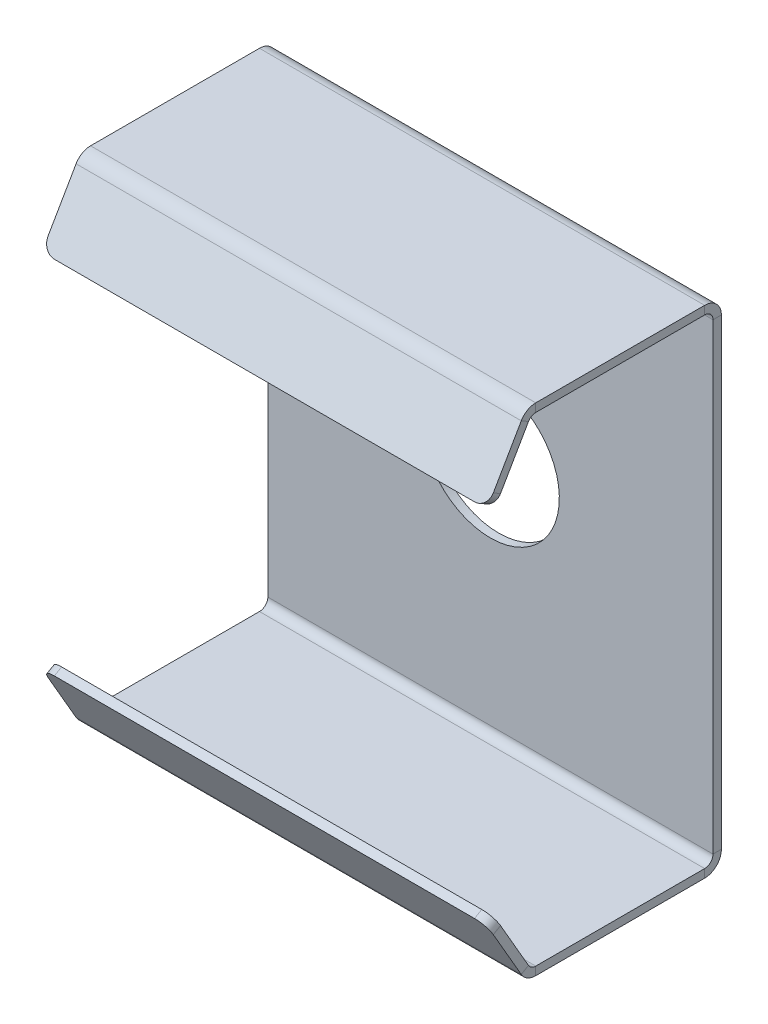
ISO-10303-21;
HEADER;
FILE_DESCRIPTION(('STEP AP214'),'2;1');
FILE_NAME('part.step','',(''),(''),'','','');
FILE_SCHEMA(('AUTOMOTIVE_DESIGN { 1 0 10303 214 1 1 1 1 }'));
ENDSEC;
DATA;
#1=APPLICATION_CONTEXT('core data for automotive mechanical design processes');
#2=APPLICATION_PROTOCOL_DEFINITION('international standard','automotive_design',2000,#1);
#3=PRODUCT_CONTEXT('',#1,'mechanical');
#4=PRODUCT('Part','Part','',(#3));
#5=PRODUCT_RELATED_PRODUCT_CATEGORY('part','',(#4));
#6=PRODUCT_DEFINITION_FORMATION('','',#4);
#7=PRODUCT_DEFINITION_CONTEXT('part definition',#1,'design');
#8=PRODUCT_DEFINITION('design','',#6,#7);
#9=PRODUCT_DEFINITION_SHAPE('','',#8);
#10=(LENGTH_UNIT() NAMED_UNIT(*) SI_UNIT(.MILLI.,.METRE.));
#11=(NAMED_UNIT(*) PLANE_ANGLE_UNIT() SI_UNIT($,.RADIAN.));
#12=(NAMED_UNIT(*) SI_UNIT($,.STERADIAN.) SOLID_ANGLE_UNIT());
#13=UNCERTAINTY_MEASURE_WITH_UNIT(LENGTH_MEASURE(1.E-05),#10,'distance_accuracy_value','');
#14=(GEOMETRIC_REPRESENTATION_CONTEXT(3) GLOBAL_UNCERTAINTY_ASSIGNED_CONTEXT((#13)) GLOBAL_UNIT_ASSIGNED_CONTEXT((#10,
#11,#12)) REPRESENTATION_CONTEXT('',''));
#15=CARTESIAN_POINT('',(0.,0.,0.));
#16=DIRECTION('',(0.,0.,1.));
#17=DIRECTION('',(1.,0.,0.));
#18=AXIS2_PLACEMENT_3D('',#15,#16,#17);
#19=CARTESIAN_POINT('',(2.56286760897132E-13,-73.4431932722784,-4.03249468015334));
#20=DIRECTION('',(0.,-0.5,0.866025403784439));
#21=DIRECTION('',(-1.,0.,0.));
#22=AXIS2_PLACEMENT_3D('',#19,#20,#21);
#23=PLANE('',#22);
#24=CARTESIAN_POINT('',(-25.15,-22.399038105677,25.4378620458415));
#25=DIRECTION('',(0.,-0.5,0.866025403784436));
#26=DIRECTION('',(-0.707106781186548,0.61237243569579,0.35355339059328));
#27=AXIS2_PLACEMENT_3D('',#24,#25,#26);
#28=CIRCLE('',#27,1.5);
#29=CARTESIAN_POINT('',(-25.15,-21.1,26.1878620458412));
#30=VERTEX_POINT('',#29);
#31=CARTESIAN_POINT('',(-26.65,-22.3990381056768,25.4378620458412));
#32=VERTEX_POINT('',#31);
#33=EDGE_CURVE('E380',#30,#32,#28,.T.);
#34=ORIENTED_EDGE('',*,*,#33,.F.);
#35=DIRECTION('',(-1.,0.,0.));
#36=VECTOR('',#35,1.);
#37=CARTESIAN_POINT('',(26.65,-21.1,26.1878620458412));
#38=LINE('',#37,#36);
#39=CARTESIAN_POINT('',(25.15,-21.1,26.1878620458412));
#40=VERTEX_POINT('',#39);
#41=EDGE_CURVE('E436',#40,#30,#38,.T.);
#42=ORIENTED_EDGE('',*,*,#41,.F.);
#43=CARTESIAN_POINT('',(25.15,-22.3990381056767,25.4378620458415));
#44=DIRECTION('',(0.,-0.5,0.866025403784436));
#45=DIRECTION('',(0.707106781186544,0.612372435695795,0.35355339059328));
#46=AXIS2_PLACEMENT_3D('',#43,#44,#45);
#47=CIRCLE('',#46,1.5);
#48=CARTESIAN_POINT('',(26.65,-22.3990381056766,25.4378620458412));
#49=VERTEX_POINT('',#48);
#50=EDGE_CURVE('E447',#49,#40,#47,.T.);
#51=ORIENTED_EDGE('',*,*,#50,.F.);
#52=DIRECTION('',(0.,-0.866025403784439,-0.5));
#53=VECTOR('',#52,1.);
#54=CARTESIAN_POINT('',(26.65,-21.1,26.1878620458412));
#55=LINE('',#54,#53);
#56=CARTESIAN_POINT('',(26.65,-28.2,22.0886751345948));
#57=VERTEX_POINT('',#56);
#58=EDGE_CURVE('E440',#49,#57,#55,.T.);
#59=ORIENTED_EDGE('',*,*,#58,.T.);
#60=DIRECTION('',(1.,0.,0.));
#61=VECTOR('',#60,1.);
#62=CARTESIAN_POINT('',(0.,-28.2,22.0886751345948));
#63=LINE('',#62,#61);
#64=CARTESIAN_POINT('',(-26.65,-28.2,22.0886751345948));
#65=VERTEX_POINT('',#64);
#66=EDGE_CURVE('E388',#65,#57,#63,.T.);
#67=ORIENTED_EDGE('',*,*,#66,.F.);
#68=DIRECTION('',(0.,-0.866025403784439,-0.5));
#69=VECTOR('',#68,1.);
#70=CARTESIAN_POINT('',(-26.65,-21.1,26.1878620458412));
#71=LINE('',#70,#69);
#72=EDGE_CURVE('E25',#32,#65,#71,.T.);
#73=ORIENTED_EDGE('',*,*,#72,.F.);
#74=EDGE_LOOP('',(#34,#42,#51,#59,#67,#73));
#75=FACE_BOUND('',#74,.T.);
#76=ADVANCED_FACE('F14',(#75),#23,.F.);
#77=CARTESIAN_POINT('',(0.,-27.7,21.2226497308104));
#78=DIRECTION('',(1.,0.,0.));
#79=DIRECTION('',(0.,-0.5,0.866025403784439));
#80=AXIS2_PLACEMENT_3D('',#77,#78,#79);
#81=CYLINDRICAL_SURFACE('',#80,2.);
#82=DIRECTION('',(-1.,0.,0.));
#83=VECTOR('',#82,1.);
#84=CARTESIAN_POINT('',(1.0376522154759E-13,-29.7,21.2226497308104));
#85=LINE('',#84,#83);
#86=CARTESIAN_POINT('',(26.65,-29.7,21.2226497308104));
#87=VERTEX_POINT('',#86);
#88=CARTESIAN_POINT('',(-26.65,-29.7,21.2226497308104));
#89=VERTEX_POINT('',#88);
#90=EDGE_CURVE('E295',#87,#89,#85,.T.);
#91=ORIENTED_EDGE('',*,*,#90,.F.);
#92=CARTESIAN_POINT('',(26.65,-27.7,21.2226497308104));
#93=DIRECTION('',(1.,0.,0.));
#94=DIRECTION('',(0.,-0.499999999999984,0.866025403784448));
#95=AXIS2_PLACEMENT_3D('',#92,#93,#94);
#96=CIRCLE('',#95,2.);
#97=CARTESIAN_POINT('',(26.65,-28.7,22.9547005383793));
#98=VERTEX_POINT('',#97);
#99=EDGE_CURVE('E9',#98,#87,#96,.T.);
#100=ORIENTED_EDGE('',*,*,#99,.F.);
#101=DIRECTION('',(-1.,0.,0.));
#102=VECTOR('',#101,1.);
#103=CARTESIAN_POINT('',(1.00273740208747E-13,-28.7,22.9547005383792));
#104=LINE('',#103,#102);
#105=CARTESIAN_POINT('',(-26.65,-28.7,22.9547005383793));
#106=VERTEX_POINT('',#105);
#107=EDGE_CURVE('E302',#98,#106,#104,.T.);
#108=ORIENTED_EDGE('',*,*,#107,.T.);
#109=CARTESIAN_POINT('',(-26.65,-27.7,21.2226497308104));
#110=DIRECTION('',(-1.,0.,0.));
#111=DIRECTION('',(0.,-1.,0.));
#112=AXIS2_PLACEMENT_3D('',#109,#110,#111);
#113=CIRCLE('',#112,2.);
#114=EDGE_CURVE('E156',#89,#106,#113,.T.);
#115=ORIENTED_EDGE('',*,*,#114,.F.);
#116=EDGE_LOOP('',(#91,#100,#108,#115));
#117=FACE_BOUND('',#116,.T.);
#118=ADVANCED_FACE('F666',(#117),#81,.T.);
#119=CARTESIAN_POINT('',(26.65,21.1,26.1878620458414));
#120=DIRECTION('',(0.,-0.866025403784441,0.5));
#121=DIRECTION('',(-1.,0.,0.));
#122=AXIS2_PLACEMENT_3D('',#119,#120,#121);
#123=PLANE('',#122);
#124=DIRECTION('',(0.,0.5,0.86602540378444));
#125=VECTOR('',#124,1.);
#126=CARTESIAN_POINT('',(-25.15,21.0999999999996,26.1878620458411));
#127=LINE('',#126,#125);
#128=CARTESIAN_POINT('',(-25.15,21.1,26.1878620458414));
#129=VERTEX_POINT('',#128);
#130=CARTESIAN_POINT('',(-25.15,21.6,27.0538874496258));
#131=VERTEX_POINT('',#130);
#132=EDGE_CURVE('E403',#129,#131,#127,.T.);
#133=ORIENTED_EDGE('',*,*,#132,.F.);
#134=DIRECTION('',(-1.,0.,0.));
#135=VECTOR('',#134,1.);
#136=CARTESIAN_POINT('',(26.65,21.1,26.1878620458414));
#137=LINE('',#136,#135);
#138=CARTESIAN_POINT('',(25.15,21.1,26.1878620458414));
#139=VERTEX_POINT('',#138);
#140=EDGE_CURVE('E332',#139,#129,#137,.T.);
#141=ORIENTED_EDGE('',*,*,#140,.F.);
#142=DIRECTION('',(0.,-0.5,-0.866025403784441));
#143=VECTOR('',#142,1.);
#144=CARTESIAN_POINT('',(25.15,21.1,26.1878620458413));
#145=LINE('',#144,#143);
#146=CARTESIAN_POINT('',(25.15,21.6,27.0538874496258));
#147=VERTEX_POINT('',#146);
#148=EDGE_CURVE('E451',#147,#139,#145,.T.);
#149=ORIENTED_EDGE('',*,*,#148,.F.);
#150=DIRECTION('',(-1.,0.,0.));
#151=VECTOR('',#150,1.);
#152=CARTESIAN_POINT('',(26.65,21.6,27.0538874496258));
#153=LINE('',#152,#151);
#154=EDGE_CURVE('E300',#147,#131,#153,.T.);
#155=ORIENTED_EDGE('',*,*,#154,.T.);
#156=EDGE_LOOP('',(#133,#141,#149,#155));
#157=FACE_BOUND('',#156,.T.);
#158=ADVANCED_FACE('F675',(#157),#123,.T.);
#159=CARTESIAN_POINT('',(26.65,-28.7,21.2226497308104));
#160=DIRECTION('',(1.,0.,0.));
#161=DIRECTION('',(0.,0.,-1.));
#162=AXIS2_PLACEMENT_3D('',#159,#160,#161);
#163=PLANE('',#162);
#164=DIRECTION('',(0.,-1.,0.));
#165=VECTOR('',#164,1.);
#166=CARTESIAN_POINT('',(26.65,-29.025,21.2226497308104));
#167=LINE('',#166,#165);
#168=CARTESIAN_POINT('',(26.65,-28.7,21.2226497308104));
#169=VERTEX_POINT('',#168);
#170=EDGE_CURVE('E239',#169,#87,#167,.T.);
#171=ORIENTED_EDGE('',*,*,#170,.F.);
#172=CARTESIAN_POINT('',(26.65,-27.7,21.2226497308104));
#173=DIRECTION('',(1.,0.,0.));
#174=DIRECTION('',(0.,-0.5,0.866025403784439));
#175=AXIS2_PLACEMENT_3D('',#172,#173,#174);
#176=CIRCLE('',#175,1.);
#177=EDGE_CURVE('E143',#57,#169,#176,.T.);
#178=ORIENTED_EDGE('',*,*,#177,.F.);
#179=DIRECTION('',(0.,-0.5,0.866025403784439));
#180=VECTOR('',#179,1.);
#181=CARTESIAN_POINT('',(26.65,-28.3625,22.3701333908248));
#182=LINE('',#181,#180);
#183=EDGE_CURVE('E444',#57,#98,#182,.T.);
#184=ORIENTED_EDGE('',*,*,#183,.T.);
#185=ORIENTED_EDGE('',*,*,#99,.T.);
#186=EDGE_LOOP('',(#171,#178,#184,#185));
#187=FACE_BOUND('',#186,.T.);
#188=ADVANCED_FACE('F683',(#187),#163,.T.);
#189=CARTESIAN_POINT('',(-26.65,-28.2,22.0886751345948));
#190=DIRECTION('',(-1.,0.,0.));
#191=DIRECTION('',(0.,1.,0.));
#192=AXIS2_PLACEMENT_3D('',#189,#190,#191);
#193=PLANE('',#192);
#194=DIRECTION('',(0.,-0.5,0.866025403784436));
#195=VECTOR('',#194,1.);
#196=CARTESIAN_POINT('',(-26.65,-22.3990381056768,25.4378620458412));
#197=LINE('',#196,#195);
#198=CARTESIAN_POINT('',(-26.65,-22.8990381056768,26.3038874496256));
#199=VERTEX_POINT('',#198);
#200=EDGE_CURVE('E375',#32,#199,#197,.T.);
#201=ORIENTED_EDGE('',*,*,#200,.F.);
#202=ORIENTED_EDGE('',*,*,#72,.T.);
#203=DIRECTION('',(0.,0.5,-0.866025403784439));
#204=VECTOR('',#203,1.);
#205=CARTESIAN_POINT('',(-26.65,-28.3625,22.3701333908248));
#206=LINE('',#205,#204);
#207=EDGE_CURVE('E320',#106,#65,#206,.T.);
#208=ORIENTED_EDGE('',*,*,#207,.F.);
#209=DIRECTION('',(0.,0.866025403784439,0.5));
#210=VECTOR('',#209,1.);
#211=CARTESIAN_POINT('',(-26.65,-21.6,27.0538874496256));
#212=LINE('',#211,#210);
#213=EDGE_CURVE('E306',#106,#199,#212,.T.);
#214=ORIENTED_EDGE('',*,*,#213,.T.);
#215=EDGE_LOOP('',(#201,#202,#208,#214));
#216=FACE_BOUND('',#215,.T.);
#217=ADVANCED_FACE('F692',(#216),#193,.T.);
#218=CARTESIAN_POINT('',(1.0006673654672E-13,-28.7,-29.2918139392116));
#219=DIRECTION('',(0.,-1.,0.));
#220=DIRECTION('',(-1.,0.,0.));
#221=AXIS2_PLACEMENT_3D('',#218,#219,#220);
#222=PLANE('',#221);
#223=DIRECTION('',(1.,0.,0.));
#224=VECTOR('',#223,1.);
#225=CARTESIAN_POINT('',(1.00133965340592E-13,-28.7,1.00000000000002));
#226=LINE('',#225,#224);
#227=CARTESIAN_POINT('',(-26.65,-28.7,1.00000000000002));
#228=VERTEX_POINT('',#227);
#229=CARTESIAN_POINT('',(26.65,-28.7,1.00000000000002));
#230=VERTEX_POINT('',#229);
#231=EDGE_CURVE('E464',#228,#230,#226,.T.);
#232=ORIENTED_EDGE('',*,*,#231,.F.);
#233=DIRECTION('',(0.,0.,-1.));
#234=VECTOR('',#233,1.);
#235=CARTESIAN_POINT('',(-26.65,-28.7,31.1488995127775));
#236=LINE('',#235,#234);
#237=CARTESIAN_POINT('',(-26.65,-28.7,21.2226497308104));
#238=VERTEX_POINT('',#237);
#239=EDGE_CURVE('E317',#238,#228,#236,.T.);
#240=ORIENTED_EDGE('',*,*,#239,.F.);
#241=DIRECTION('',(1.,0.,0.));
#242=VECTOR('',#241,1.);
#243=CARTESIAN_POINT('',(1.00133965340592E-13,-28.7,21.2226497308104));
#244=LINE('',#243,#242);
#245=EDGE_CURVE('E238',#238,#169,#244,.T.);
#246=ORIENTED_EDGE('',*,*,#245,.T.);
#247=DIRECTION('',(0.,0.,-1.));
#248=VECTOR('',#247,1.);
#249=CARTESIAN_POINT('',(26.65,-28.7,31.1488995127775));
#250=LINE('',#249,#248);
#251=EDGE_CURVE('E381',#169,#230,#250,.T.);
#252=ORIENTED_EDGE('',*,*,#251,.T.);
#253=EDGE_LOOP('',(#232,#240,#246,#252));
#254=FACE_BOUND('',#253,.T.);
#255=ADVANCED_FACE('F701',(#254),#222,.F.);
#256=CARTESIAN_POINT('',(-26.65,-28.7,22.9505256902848));
#257=DIRECTION('',(-1.,0.,0.));
#258=DIRECTION('',(0.,1.,0.));
#259=AXIS2_PLACEMENT_3D('',#256,#257,#258);
#260=PLANE('',#259);
#261=DIRECTION('',(0.,1.,0.));
#262=VECTOR('',#261,1.);
#263=CARTESIAN_POINT('',(-26.65,-29.025,1.00000000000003));
#264=LINE('',#263,#262);
#265=CARTESIAN_POINT('',(-26.65,-29.7,1.00000000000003));
#266=VERTEX_POINT('',#265);
#267=EDGE_CURVE('E360',#266,#228,#264,.T.);
#268=ORIENTED_EDGE('',*,*,#267,.F.);
#269=DIRECTION('',(0.,0.,1.));
#270=VECTOR('',#269,1.);
#271=CARTESIAN_POINT('',(-26.65,-29.7,31.1488995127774));
#272=LINE('',#271,#270);
#273=EDGE_CURVE('E393',#266,#89,#272,.T.);
#274=ORIENTED_EDGE('',*,*,#273,.T.);
#275=DIRECTION('',(0.,1.,0.));
#276=VECTOR('',#275,1.);
#277=CARTESIAN_POINT('',(-26.65,-29.025,21.2226497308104));
#278=LINE('',#277,#276);
#279=EDGE_CURVE('E389',#89,#238,#278,.T.);
#280=ORIENTED_EDGE('',*,*,#279,.T.);
#281=ORIENTED_EDGE('',*,*,#239,.T.);
#282=EDGE_LOOP('',(#268,#274,#280,#281));
#283=FACE_BOUND('',#282,.T.);
#284=ADVANCED_FACE('F709',(#283),#260,.T.);
#285=CARTESIAN_POINT('',(-26.65,-29.7,21.2226497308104));
#286=DIRECTION('',(-1.,0.,0.));
#287=DIRECTION('',(0.,1.,0.));
#288=AXIS2_PLACEMENT_3D('',#285,#286,#287);
#289=PLANE('',#288);
#290=ORIENTED_EDGE('',*,*,#279,.F.);
#291=ORIENTED_EDGE('',*,*,#114,.T.);
#292=ORIENTED_EDGE('',*,*,#207,.T.);
#293=CARTESIAN_POINT('',(-26.65,-27.7,21.2226497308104));
#294=DIRECTION('',(1.,0.,0.));
#295=DIRECTION('',(0.,-0.5,0.866025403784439));
#296=AXIS2_PLACEMENT_3D('',#293,#294,#295);
#297=CIRCLE('',#296,1.);
#298=EDGE_CURVE('E384',#65,#238,#297,.T.);
#299=ORIENTED_EDGE('',*,*,#298,.T.);
#300=EDGE_LOOP('',(#290,#291,#292,#299));
#301=FACE_BOUND('',#300,.T.);
#302=ADVANCED_FACE('F718',(#301),#289,.T.);
#303=CARTESIAN_POINT('',(0.,-27.7,1.00000000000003));
#304=DIRECTION('',(1.,0.,0.));
#305=DIRECTION('',(0.,-1.,0.));
#306=AXIS2_PLACEMENT_3D('',#303,#304,#305);
#307=CYLINDRICAL_SURFACE('',#306,2.);
#308=DIRECTION('',(-1.,0.,0.));
#309=VECTOR('',#308,1.);
#310=CARTESIAN_POINT('',(0.,-27.7,-0.99999999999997));
#311=LINE('',#310,#309);
#312=CARTESIAN_POINT('',(26.65,-27.7,-0.999999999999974));
#313=VERTEX_POINT('',#312);
#314=CARTESIAN_POINT('',(-26.65,-27.7,-0.999999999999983));
#315=VERTEX_POINT('',#314);
#316=EDGE_CURVE('E252',#313,#315,#311,.T.);
#317=ORIENTED_EDGE('',*,*,#316,.F.);
#318=CARTESIAN_POINT('',(26.65,-27.7,1.00000000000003));
#319=DIRECTION('',(1.,0.,0.));
#320=DIRECTION('',(0.,-1.,0.));
#321=AXIS2_PLACEMENT_3D('',#318,#319,#320);
#322=CIRCLE('',#321,2.);
#323=CARTESIAN_POINT('',(26.65,-29.7,1.00000000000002));
#324=VERTEX_POINT('',#323);
#325=EDGE_CURVE('E225',#324,#313,#322,.T.);
#326=ORIENTED_EDGE('',*,*,#325,.F.);
#327=DIRECTION('',(-1.,0.,0.));
#328=VECTOR('',#327,1.);
#329=CARTESIAN_POINT('',(1.0376522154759E-13,-29.7,1.00000000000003));
#330=LINE('',#329,#328);
#331=EDGE_CURVE('E296',#324,#266,#330,.T.);
#332=ORIENTED_EDGE('',*,*,#331,.T.);
#333=CARTESIAN_POINT('',(-26.65,-27.7,1.00000000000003));
#334=DIRECTION('',(-1.,0.,0.));
#335=DIRECTION('',(0.,0.,-1.));
#336=AXIS2_PLACEMENT_3D('',#333,#334,#335);
#337=CIRCLE('',#336,2.);
#338=EDGE_CURVE('E255',#315,#266,#337,.T.);
#339=ORIENTED_EDGE('',*,*,#338,.F.);
#340=EDGE_LOOP('',(#317,#326,#332,#339));
#341=FACE_BOUND('',#340,.T.);
#342=ADVANCED_FACE('F253',(#341),#307,.T.);
#343=CARTESIAN_POINT('',(0.,-27.7,21.2226497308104));
#344=DIRECTION('',(1.,0.,0.));
#345=DIRECTION('',(0.,-0.5,0.866025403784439));
#346=AXIS2_PLACEMENT_3D('',#343,#344,#345);
#347=CYLINDRICAL_SURFACE('',#346,1.);
#348=ORIENTED_EDGE('',*,*,#245,.F.);
#349=ORIENTED_EDGE('',*,*,#298,.F.);
#350=ORIENTED_EDGE('',*,*,#66,.T.);
#351=ORIENTED_EDGE('',*,*,#177,.T.);
#352=EDGE_LOOP('',(#348,#349,#350,#351));
#353=FACE_BOUND('',#352,.T.);
#354=ADVANCED_FACE('F735',(#353),#347,.F.);
#355=CARTESIAN_POINT('',(26.65,-27.7,0.));
#356=DIRECTION('',(1.,0.,0.));
#357=DIRECTION('',(0.,0.,-1.));
#358=AXIS2_PLACEMENT_3D('',#355,#356,#357);
#359=PLANE('',#358);
#360=DIRECTION('',(0.,0.,-1.));
#361=VECTOR('',#360,1.);
#362=CARTESIAN_POINT('',(26.65,-27.7,-0.324999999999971));
#363=LINE('',#362,#361);
#364=CARTESIAN_POINT('',(26.65,-27.7,0.));
#365=VERTEX_POINT('',#364);
#366=EDGE_CURVE('E229',#365,#313,#363,.T.);
#367=ORIENTED_EDGE('',*,*,#366,.F.);
#368=CARTESIAN_POINT('',(26.65,-27.7,1.00000000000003));
#369=DIRECTION('',(1.,0.,0.));
#370=DIRECTION('',(0.,-1.,0.));
#371=AXIS2_PLACEMENT_3D('',#368,#369,#370);
#372=CIRCLE('',#371,1.);
#373=EDGE_CURVE('E286',#230,#365,#372,.T.);
#374=ORIENTED_EDGE('',*,*,#373,.F.);
#375=DIRECTION('',(0.,-1.,0.));
#376=VECTOR('',#375,1.);
#377=CARTESIAN_POINT('',(26.65,-29.025,1.00000000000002));
#378=LINE('',#377,#376);
#379=EDGE_CURVE('E232',#230,#324,#378,.T.);
#380=ORIENTED_EDGE('',*,*,#379,.T.);
#381=ORIENTED_EDGE('',*,*,#325,.T.);
#382=EDGE_LOOP('',(#367,#374,#380,#381));
#383=FACE_BOUND('',#382,.T.);
#384=ADVANCED_FACE('F227',(#383),#359,.T.);
#385=CARTESIAN_POINT('',(26.65,-28.7,-81.5341535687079));
#386=DIRECTION('',(1.,0.,0.));
#387=DIRECTION('',(0.,0.,-1.));
#388=AXIS2_PLACEMENT_3D('',#385,#386,#387);
#389=PLANE('',#388);
#390=ORIENTED_EDGE('',*,*,#379,.F.);
#391=ORIENTED_EDGE('',*,*,#251,.F.);
#392=ORIENTED_EDGE('',*,*,#170,.T.);
#393=DIRECTION('',(0.,0.,-1.));
#394=VECTOR('',#393,1.);
#395=CARTESIAN_POINT('',(26.65,-29.7,-81.5341535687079));
#396=LINE('',#395,#394);
#397=EDGE_CURVE('E292',#87,#324,#396,.T.);
#398=ORIENTED_EDGE('',*,*,#397,.T.);
#399=EDGE_LOOP('',(#390,#391,#392,#398));
#400=FACE_BOUND('',#399,.T.);
#401=ADVANCED_FACE('F750',(#400),#389,.T.);
#402=CARTESIAN_POINT('',(0.,0.,1.37667655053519E-13));
#403=DIRECTION('',(0.,0.,-1.));
#404=DIRECTION('',(1.,0.,0.));
#405=AXIS2_PLACEMENT_3D('',#402,#403,#404);
#406=PLANE('',#405);
#407=CARTESIAN_POINT('',(0.,0.,1.4210854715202E-13));
#408=DIRECTION('',(0.,0.,-1.));
#409=DIRECTION('',(0.,1.,0.));
#410=AXIS2_PLACEMENT_3D('',#407,#408,#409);
#411=CIRCLE('',#410,8.25);
#412=CARTESIAN_POINT('',(0.,-8.25,1.06581410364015E-13));
#413=VERTEX_POINT('',#412);
#414=EDGE_CURVE('E432',#413,#413,#411,.T.);
#415=ORIENTED_EDGE('',*,*,#414,.T.);
#416=EDGE_LOOP('',(#415));
#417=FACE_BOUND('',#416,.T.);
#418=DIRECTION('',(1.,0.,0.));
#419=VECTOR('',#418,1.);
#420=CARTESIAN_POINT('',(0.,27.7,2.30926389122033E-13));
#421=LINE('',#420,#419);
#422=CARTESIAN_POINT('',(-26.65,27.7,2.35367281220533E-13));
#423=VERTEX_POINT('',#422);
#424=CARTESIAN_POINT('',(26.65,27.7,2.35367281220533E-13));
#425=VERTEX_POINT('',#424);
#426=EDGE_CURVE('E370',#423,#425,#421,.T.);
#427=ORIENTED_EDGE('',*,*,#426,.F.);
#428=DIRECTION('',(0.,1.,0.));
#429=VECTOR('',#428,1.);
#430=CARTESIAN_POINT('',(-26.65,-60.4407134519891,-1.06581410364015E-13));
#431=LINE('',#430,#429);
#432=CARTESIAN_POINT('',(-26.65,-27.7,0.));
#433=VERTEX_POINT('',#432);
#434=EDGE_CURVE('E316',#433,#423,#431,.T.);
#435=ORIENTED_EDGE('',*,*,#434,.F.);
#436=DIRECTION('',(1.,0.,0.));
#437=VECTOR('',#436,1.);
#438=CARTESIAN_POINT('',(0.,-27.7,0.));
#439=LINE('',#438,#437);
#440=EDGE_CURVE('E343',#433,#365,#439,.T.);
#441=ORIENTED_EDGE('',*,*,#440,.T.);
#442=DIRECTION('',(0.,1.,0.));
#443=VECTOR('',#442,1.);
#444=CARTESIAN_POINT('',(26.65,-60.4407134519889,-1.06581410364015E-13));
#445=LINE('',#444,#443);
#446=EDGE_CURVE('E247',#365,#425,#445,.T.);
#447=ORIENTED_EDGE('',*,*,#446,.T.);
#448=EDGE_LOOP('',(#427,#435,#441,#447));
#449=FACE_BOUND('',#448,.T.);
#450=ADVANCED_FACE('F758',(#417,#449),#406,.F.);
#451=CARTESIAN_POINT('',(1.03835773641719E-13,-29.7,-29.2918139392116));
#452=DIRECTION('',(0.,-1.,0.));
#453=DIRECTION('',(-1.,0.,0.));
#454=AXIS2_PLACEMENT_3D('',#451,#452,#453);
#455=PLANE('',#454);
#456=ORIENTED_EDGE('',*,*,#331,.F.);
#457=ORIENTED_EDGE('',*,*,#397,.F.);
#458=ORIENTED_EDGE('',*,*,#90,.T.);
#459=ORIENTED_EDGE('',*,*,#273,.F.);
#460=EDGE_LOOP('',(#456,#457,#458,#459));
#461=FACE_BOUND('',#460,.T.);
#462=ADVANCED_FACE('F767',(#461),#455,.T.);
#463=CARTESIAN_POINT('',(-26.65,-52.2423396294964,0.));
#464=DIRECTION('',(-1.,0.,0.));
#465=DIRECTION('',(0.,1.,0.));
#466=AXIS2_PLACEMENT_3D('',#463,#464,#465);
#467=PLANE('',#466);
#468=DIRECTION('',(0.,0.,1.));
#469=VECTOR('',#468,1.);
#470=CARTESIAN_POINT('',(-26.65,27.7,-0.324999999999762));
#471=LINE('',#470,#469);
#472=CARTESIAN_POINT('',(-26.65,27.7,-0.999999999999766));
#473=VERTEX_POINT('',#472);
#474=EDGE_CURVE('E276',#473,#423,#471,.T.);
#475=ORIENTED_EDGE('',*,*,#474,.F.);
#476=DIRECTION('',(0.,-1.,0.));
#477=VECTOR('',#476,1.);
#478=CARTESIAN_POINT('',(-26.65,-60.4407134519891,-1.00000000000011));
#479=LINE('',#478,#477);
#480=EDGE_CURVE('E259',#473,#315,#479,.T.);
#481=ORIENTED_EDGE('',*,*,#480,.T.);
#482=DIRECTION('',(0.,0.,1.));
#483=VECTOR('',#482,1.);
#484=CARTESIAN_POINT('',(-26.65,-27.7,-0.324999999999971));
#485=LINE('',#484,#483);
#486=EDGE_CURVE('E282',#315,#433,#485,.T.);
#487=ORIENTED_EDGE('',*,*,#486,.T.);
#488=ORIENTED_EDGE('',*,*,#434,.T.);
#489=EDGE_LOOP('',(#475,#481,#487,#488));
#490=FACE_BOUND('',#489,.T.);
#491=ADVANCED_FACE('F775',(#490),#467,.T.);
#492=CARTESIAN_POINT('',(-26.65,-27.7,-0.999999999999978));
#493=DIRECTION('',(-1.,0.,0.));
#494=DIRECTION('',(0.,1.,0.));
#495=AXIS2_PLACEMENT_3D('',#492,#493,#494);
#496=PLANE('',#495);
#497=ORIENTED_EDGE('',*,*,#486,.F.);
#498=ORIENTED_EDGE('',*,*,#338,.T.);
#499=ORIENTED_EDGE('',*,*,#267,.T.);
#500=CARTESIAN_POINT('',(-26.65,-27.7,1.00000000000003));
#501=DIRECTION('',(1.,0.,0.));
#502=DIRECTION('',(0.,-1.,0.));
#503=AXIS2_PLACEMENT_3D('',#500,#501,#502);
#504=CIRCLE('',#503,1.);
#505=EDGE_CURVE('E346',#228,#433,#504,.T.);
#506=ORIENTED_EDGE('',*,*,#505,.T.);
#507=EDGE_LOOP('',(#497,#498,#499,#506));
#508=FACE_BOUND('',#507,.T.);
#509=ADVANCED_FACE('F784',(#508),#496,.T.);
#510=CARTESIAN_POINT('',(0.,27.7,1.00000000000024));
#511=DIRECTION('',(1.,0.,0.));
#512=DIRECTION('',(0.,0.,-1.));
#513=AXIS2_PLACEMENT_3D('',#510,#511,#512);
#514=CYLINDRICAL_SURFACE('',#513,2.);
#515=DIRECTION('',(-1.,0.,0.));
#516=VECTOR('',#515,1.);
#517=CARTESIAN_POINT('',(-1.03628769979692E-13,29.7,1.00000000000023));
#518=LINE('',#517,#516);
#519=CARTESIAN_POINT('',(26.65,29.7,1.00000000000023));
#520=VERTEX_POINT('',#519);
#521=CARTESIAN_POINT('',(-26.65,29.7,1.00000000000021));
#522=VERTEX_POINT('',#521);
#523=EDGE_CURVE('E348',#520,#522,#518,.T.);
#524=ORIENTED_EDGE('',*,*,#523,.F.);
#525=CARTESIAN_POINT('',(26.65,27.7,1.00000000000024));
#526=DIRECTION('',(1.,0.,0.));
#527=DIRECTION('',(0.,0.,-1.));
#528=AXIS2_PLACEMENT_3D('',#525,#526,#527);
#529=CIRCLE('',#528,2.);
#530=CARTESIAN_POINT('',(26.65,27.7,-0.999999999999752));
#531=VERTEX_POINT('',#530);
#532=EDGE_CURVE('E249',#531,#520,#529,.T.);
#533=ORIENTED_EDGE('',*,*,#532,.F.);
#534=DIRECTION('',(-1.,0.,0.));
#535=VECTOR('',#534,1.);
#536=CARTESIAN_POINT('',(0.,27.7,-0.999999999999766));
#537=LINE('',#536,#535);
#538=EDGE_CURVE('E262',#531,#473,#537,.T.);
#539=ORIENTED_EDGE('',*,*,#538,.T.);
#540=CARTESIAN_POINT('',(-26.65,27.7,1.00000000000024));
#541=DIRECTION('',(-1.,0.,0.));
#542=DIRECTION('',(0.,1.,0.));
#543=AXIS2_PLACEMENT_3D('',#540,#541,#542);
#544=CIRCLE('',#543,2.);
#545=EDGE_CURVE('E1234',#522,#473,#544,.T.);
#546=ORIENTED_EDGE('',*,*,#545,.F.);
#547=EDGE_LOOP('',(#524,#533,#539,#546));
#548=FACE_BOUND('',#547,.T.);
#549=ADVANCED_FACE('F793',(#548),#514,.T.);
#550=CARTESIAN_POINT('',(0.,-27.7,1.00000000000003));
#551=DIRECTION('',(1.,0.,0.));
#552=DIRECTION('',(0.,-1.,0.));
#553=AXIS2_PLACEMENT_3D('',#550,#551,#552);
#554=CYLINDRICAL_SURFACE('',#553,1.);
#555=ORIENTED_EDGE('',*,*,#440,.F.);
#556=ORIENTED_EDGE('',*,*,#505,.F.);
#557=ORIENTED_EDGE('',*,*,#231,.T.);
#558=ORIENTED_EDGE('',*,*,#373,.T.);
#559=EDGE_LOOP('',(#555,#556,#557,#558));
#560=FACE_BOUND('',#559,.T.);
#561=ADVANCED_FACE('F802',(#560),#554,.F.);
#562=CARTESIAN_POINT('',(26.65,28.7,1.00000000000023));
#563=DIRECTION('',(1.,0.,0.));
#564=DIRECTION('',(0.,0.,-1.));
#565=AXIS2_PLACEMENT_3D('',#562,#563,#564);
#566=PLANE('',#565);
#567=DIRECTION('',(0.,1.,0.));
#568=VECTOR('',#567,1.);
#569=CARTESIAN_POINT('',(26.65,29.025,1.00000000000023));
#570=LINE('',#569,#568);
#571=CARTESIAN_POINT('',(26.65,28.7,1.00000000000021));
#572=VERTEX_POINT('',#571);
#573=EDGE_CURVE('E310',#572,#520,#570,.T.);
#574=ORIENTED_EDGE('',*,*,#573,.F.);
#575=CARTESIAN_POINT('',(26.65,27.7,1.00000000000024));
#576=DIRECTION('',(1.,0.,0.));
#577=DIRECTION('',(0.,0.,-1.));
#578=AXIS2_PLACEMENT_3D('',#575,#576,#577);
#579=CIRCLE('',#578,1.);
#580=EDGE_CURVE('E374',#425,#572,#579,.T.);
#581=ORIENTED_EDGE('',*,*,#580,.F.);
#582=DIRECTION('',(0.,0.,-1.));
#583=VECTOR('',#582,1.);
#584=CARTESIAN_POINT('',(26.65,27.7,-0.324999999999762));
#585=LINE('',#584,#583);
#586=EDGE_CURVE('E313',#425,#531,#585,.T.);
#587=ORIENTED_EDGE('',*,*,#586,.T.);
#588=ORIENTED_EDGE('',*,*,#532,.T.);
#589=EDGE_LOOP('',(#574,#581,#587,#588));
#590=FACE_BOUND('',#589,.T.);
#591=ADVANCED_FACE('F810',(#590),#566,.T.);
#592=CARTESIAN_POINT('',(26.65,52.2423396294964,3.46389583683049E-13));
#593=DIRECTION('',(1.,0.,0.));
#594=DIRECTION('',(0.,0.,-1.));
#595=AXIS2_PLACEMENT_3D('',#592,#593,#594);
#596=PLANE('',#595);
#597=ORIENTED_EDGE('',*,*,#586,.F.);
#598=ORIENTED_EDGE('',*,*,#446,.F.);
#599=ORIENTED_EDGE('',*,*,#366,.T.);
#600=DIRECTION('',(0.,1.,0.));
#601=VECTOR('',#600,1.);
#602=CARTESIAN_POINT('',(26.65,52.2423396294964,-0.999999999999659));
#603=LINE('',#602,#601);
#604=EDGE_CURVE('E18',#313,#531,#603,.T.);
#605=ORIENTED_EDGE('',*,*,#604,.T.);
#606=EDGE_LOOP('',(#597,#598,#599,#605));
#607=FACE_BOUND('',#606,.T.);
#608=ADVANCED_FACE('F244',(#607),#596,.T.);
#609=CARTESIAN_POINT('',(-1.00344292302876E-13,28.7,-29.2918139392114));
#610=DIRECTION('',(0.,1.,0.));
#611=DIRECTION('',(0.,0.,1.));
#612=AXIS2_PLACEMENT_3D('',#609,#610,#611);
#613=PLANE('',#612);
#614=DIRECTION('',(1.,0.,0.));
#615=VECTOR('',#614,1.);
#616=CARTESIAN_POINT('',(-1.00277063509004E-13,28.7,21.2226497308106));
#617=LINE('',#616,#615);
#618=CARTESIAN_POINT('',(-26.65,28.7,21.2226497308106));
#619=VERTEX_POINT('',#618);
#620=CARTESIAN_POINT('',(26.65,28.7,21.2226497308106));
#621=VERTEX_POINT('',#620);
#622=EDGE_CURVE('E1274',#619,#621,#617,.T.);
#623=ORIENTED_EDGE('',*,*,#622,.F.);
#624=DIRECTION('',(0.,0.,1.));
#625=VECTOR('',#624,1.);
#626=CARTESIAN_POINT('',(-26.65,28.7000000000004,-89.7325273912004));
#627=LINE('',#626,#625);
#628=CARTESIAN_POINT('',(-26.65,28.7,1.00000000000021));
#629=VERTEX_POINT('',#628);
#630=EDGE_CURVE('E268',#629,#619,#627,.T.);
#631=ORIENTED_EDGE('',*,*,#630,.F.);
#632=DIRECTION('',(1.,0.,0.));
#633=VECTOR('',#632,1.);
#634=CARTESIAN_POINT('',(-1.00277063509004E-13,28.7,1.00000000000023));
#635=LINE('',#634,#633);
#636=EDGE_CURVE('E337',#629,#572,#635,.T.);
#637=ORIENTED_EDGE('',*,*,#636,.T.);
#638=DIRECTION('',(0.,0.,1.));
#639=VECTOR('',#638,1.);
#640=CARTESIAN_POINT('',(26.65,28.7000000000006,-89.7325273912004));
#641=LINE('',#640,#639);
#642=EDGE_CURVE('E307',#572,#621,#641,.T.);
#643=ORIENTED_EDGE('',*,*,#642,.T.);
#644=EDGE_LOOP('',(#623,#631,#637,#643));
#645=FACE_BOUND('',#644,.T.);
#646=ADVANCED_FACE('F827',(#645),#613,.F.);
#647=CARTESIAN_POINT('',(0.,0.,-0.999999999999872));
#648=DIRECTION('',(0.,0.,-1.));
#649=DIRECTION('',(1.,0.,0.));
#650=AXIS2_PLACEMENT_3D('',#647,#648,#649);
#651=PLANE('',#650);
#652=CARTESIAN_POINT('',(0.,0.,-0.999999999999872));
#653=DIRECTION('',(0.,0.,1.));
#654=DIRECTION('',(0.,1.,0.));
#655=AXIS2_PLACEMENT_3D('',#652,#653,#654);
#656=CIRCLE('',#655,8.25);
#657=CARTESIAN_POINT('',(0.,-8.25,-0.999999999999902));
#658=VERTEX_POINT('',#657);
#659=EDGE_CURVE('E327',#658,#658,#656,.T.);
#660=ORIENTED_EDGE('',*,*,#659,.T.);
#661=EDGE_LOOP('',(#660));
#662=FACE_BOUND('',#661,.T.);
#663=ORIENTED_EDGE('',*,*,#538,.F.);
#664=ORIENTED_EDGE('',*,*,#604,.F.);
#665=ORIENTED_EDGE('',*,*,#316,.T.);
#666=ORIENTED_EDGE('',*,*,#480,.F.);
#667=EDGE_LOOP('',(#663,#664,#665,#666));
#668=FACE_BOUND('',#667,.T.);
#669=ADVANCED_FACE('F16',(#662,#668),#651,.T.);
#670=CARTESIAN_POINT('',(-26.65,28.7000000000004,-81.5341535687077));
#671=DIRECTION('',(-1.,0.,0.));
#672=DIRECTION('',(0.,1.,0.));
#673=AXIS2_PLACEMENT_3D('',#670,#671,#672);
#674=PLANE('',#673);
#675=DIRECTION('',(0.,-1.,0.));
#676=VECTOR('',#675,1.);
#677=CARTESIAN_POINT('',(-26.65,29.025,21.2226497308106));
#678=LINE('',#677,#676);
#679=CARTESIAN_POINT('',(-26.65,29.7,21.2226497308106));
#680=VERTEX_POINT('',#679);
#681=EDGE_CURVE('E364',#680,#619,#678,.T.);
#682=ORIENTED_EDGE('',*,*,#681,.F.);
#683=DIRECTION('',(0.,0.,-1.));
#684=VECTOR('',#683,1.);
#685=CARTESIAN_POINT('',(-26.65,29.7000000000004,-89.7325273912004));
#686=LINE('',#685,#684);
#687=EDGE_CURVE('E336',#680,#522,#686,.T.);
#688=ORIENTED_EDGE('',*,*,#687,.T.);
#689=DIRECTION('',(0.,-1.,0.));
#690=VECTOR('',#689,1.);
#691=CARTESIAN_POINT('',(-26.65,29.025,1.00000000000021));
#692=LINE('',#691,#690);
#693=EDGE_CURVE('E1238',#522,#629,#692,.T.);
#694=ORIENTED_EDGE('',*,*,#693,.T.);
#695=ORIENTED_EDGE('',*,*,#630,.T.);
#696=EDGE_LOOP('',(#682,#688,#694,#695));
#697=FACE_BOUND('',#696,.T.);
#698=ADVANCED_FACE('F843',(#697),#674,.T.);
#699=CARTESIAN_POINT('',(-26.65,29.7,1.00000000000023));
#700=DIRECTION('',(-1.,0.,0.));
#701=DIRECTION('',(0.,1.,0.));
#702=AXIS2_PLACEMENT_3D('',#699,#700,#701);
#703=PLANE('',#702);
#704=ORIENTED_EDGE('',*,*,#693,.F.);
#705=ORIENTED_EDGE('',*,*,#545,.T.);
#706=ORIENTED_EDGE('',*,*,#474,.T.);
#707=CARTESIAN_POINT('',(-26.65,27.7,1.00000000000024));
#708=DIRECTION('',(1.,0.,0.));
#709=DIRECTION('',(0.,0.,-1.));
#710=AXIS2_PLACEMENT_3D('',#707,#708,#709);
#711=CIRCLE('',#710,1.);
#712=EDGE_CURVE('E341',#423,#629,#711,.T.);
#713=ORIENTED_EDGE('',*,*,#712,.T.);
#714=EDGE_LOOP('',(#704,#705,#706,#713));
#715=FACE_BOUND('',#714,.T.);
#716=ADVANCED_FACE('F851',(#715),#703,.T.);
#717=CARTESIAN_POINT('',(0.,27.7,21.2226497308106));
#718=DIRECTION('',(1.,0.,0.));
#719=DIRECTION('',(0.,1.,0.));
#720=AXIS2_PLACEMENT_3D('',#717,#718,#719);
#721=CYLINDRICAL_SURFACE('',#720,2.);
#722=DIRECTION('',(-1.,0.,0.));
#723=VECTOR('',#722,1.);
#724=CARTESIAN_POINT('',(-1.00137288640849E-13,28.7,22.9547005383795));
#725=LINE('',#724,#723);
#726=CARTESIAN_POINT('',(26.65,28.7,22.9547005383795));
#727=VERTEX_POINT('',#726);
#728=CARTESIAN_POINT('',(-26.65,28.7,22.9547005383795));
#729=VERTEX_POINT('',#728);
#730=EDGE_CURVE('E325',#727,#729,#725,.T.);
#731=ORIENTED_EDGE('',*,*,#730,.F.);
#732=CARTESIAN_POINT('',(26.65,27.7,21.2226497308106));
#733=DIRECTION('',(1.,0.,0.));
#734=DIRECTION('',(0.,1.,0.));
#735=AXIS2_PLACEMENT_3D('',#732,#733,#734);
#736=CIRCLE('',#735,2.);
#737=CARTESIAN_POINT('',(26.65,29.7,21.2226497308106));
#738=VERTEX_POINT('',#737);
#739=EDGE_CURVE('E342',#738,#727,#736,.T.);
#740=ORIENTED_EDGE('',*,*,#739,.F.);
#741=DIRECTION('',(-1.,0.,0.));
#742=VECTOR('',#741,1.);
#743=CARTESIAN_POINT('',(-1.03628769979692E-13,29.7,21.2226497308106));
#744=LINE('',#743,#742);
#745=EDGE_CURVE('E368',#738,#680,#744,.T.);
#746=ORIENTED_EDGE('',*,*,#745,.T.);
#747=CARTESIAN_POINT('',(-26.65,27.7,21.2226497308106));
#748=DIRECTION('',(-1.,0.,0.));
#749=DIRECTION('',(0.,0.49999999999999,0.866025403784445));
#750=AXIS2_PLACEMENT_3D('',#747,#748,#749);
#751=CIRCLE('',#750,2.);
#752=EDGE_CURVE('E369',#729,#680,#751,.T.);
#753=ORIENTED_EDGE('',*,*,#752,.F.);
#754=EDGE_LOOP('',(#731,#740,#746,#753));
#755=FACE_BOUND('',#754,.T.);
#756=ADVANCED_FACE('F860',(#755),#721,.T.);
#757=CARTESIAN_POINT('',(0.,27.7,1.00000000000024));
#758=DIRECTION('',(1.,0.,0.));
#759=DIRECTION('',(0.,0.,-1.));
#760=AXIS2_PLACEMENT_3D('',#757,#758,#759);
#761=CYLINDRICAL_SURFACE('',#760,1.);
#762=ORIENTED_EDGE('',*,*,#636,.F.);
#763=ORIENTED_EDGE('',*,*,#712,.F.);
#764=ORIENTED_EDGE('',*,*,#426,.T.);
#765=ORIENTED_EDGE('',*,*,#580,.T.);
#766=EDGE_LOOP('',(#762,#763,#764,#765));
#767=FACE_BOUND('',#766,.T.);
#768=ADVANCED_FACE('F869',(#767),#761,.F.);
#769=CARTESIAN_POINT('',(26.65,28.2,22.088675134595));
#770=DIRECTION('',(1.,0.,0.));
#771=DIRECTION('',(0.,0.,-1.));
#772=AXIS2_PLACEMENT_3D('',#769,#770,#771);
#773=PLANE('',#772);
#774=DIRECTION('',(0.,0.5,0.866025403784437));
#775=VECTOR('',#774,1.);
#776=CARTESIAN_POINT('',(26.65,28.3625,22.370133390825));
#777=LINE('',#776,#775);
#778=CARTESIAN_POINT('',(26.65,28.2,22.088675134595));
#779=VERTEX_POINT('',#778);
#780=EDGE_CURVE('E290',#779,#727,#777,.T.);
#781=ORIENTED_EDGE('',*,*,#780,.F.);
#782=CARTESIAN_POINT('',(26.65,27.7,21.2226497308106));
#783=DIRECTION('',(1.,0.,0.));
#784=DIRECTION('',(0.,1.,0.));
#785=AXIS2_PLACEMENT_3D('',#782,#783,#784);
#786=CIRCLE('',#785,0.999999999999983);
#787=EDGE_CURVE('E1224',#621,#779,#786,.T.);
#788=ORIENTED_EDGE('',*,*,#787,.F.);
#789=DIRECTION('',(0.,1.,0.));
#790=VECTOR('',#789,1.);
#791=CARTESIAN_POINT('',(26.65,29.025,21.2226497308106));
#792=LINE('',#791,#790);
#793=EDGE_CURVE('E280',#621,#738,#792,.T.);
#794=ORIENTED_EDGE('',*,*,#793,.T.);
#795=ORIENTED_EDGE('',*,*,#739,.T.);
#796=EDGE_LOOP('',(#781,#788,#794,#795));
#797=FACE_BOUND('',#796,.T.);
#798=ADVANCED_FACE('F878',(#797),#773,.T.);
#799=CARTESIAN_POINT('',(26.65,28.7,22.950525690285));
#800=DIRECTION('',(1.,0.,0.));
#801=DIRECTION('',(0.,0.,-1.));
#802=AXIS2_PLACEMENT_3D('',#799,#800,#801);
#803=PLANE('',#802);
#804=ORIENTED_EDGE('',*,*,#793,.F.);
#805=ORIENTED_EDGE('',*,*,#642,.F.);
#806=ORIENTED_EDGE('',*,*,#573,.T.);
#807=DIRECTION('',(0.,0.,1.));
#808=VECTOR('',#807,1.);
#809=CARTESIAN_POINT('',(26.65,29.7,22.950525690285));
#810=LINE('',#809,#808);
#811=EDGE_CURVE('E352',#520,#738,#810,.T.);
#812=ORIENTED_EDGE('',*,*,#811,.T.);
#813=EDGE_LOOP('',(#804,#805,#806,#812));
#814=FACE_BOUND('',#813,.T.);
#815=ADVANCED_FACE('F887',(#814),#803,.T.);
#816=CARTESIAN_POINT('',(-2.56564316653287E-13,73.4431932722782,-4.03249468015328));
#817=DIRECTION('',(0.,0.5,0.866025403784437));
#818=DIRECTION('',(1.,0.,0.));
#819=AXIS2_PLACEMENT_3D('',#816,#817,#818);
#820=PLANE('',#819);
#821=CARTESIAN_POINT('',(-25.15,22.3990381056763,25.4378620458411));
#822=DIRECTION('',(0.,0.5,0.866025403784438));
#823=DIRECTION('',(-0.707106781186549,-0.612372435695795,0.353553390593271));
#824=AXIS2_PLACEMENT_3D('',#821,#822,#823);
#825=CIRCLE('',#824,1.5);
#826=CARTESIAN_POINT('',(-26.65,22.3990381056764,25.4378620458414));
#827=VERTEX_POINT('',#826);
#828=EDGE_CURVE('E417',#827,#129,#825,.T.);
#829=ORIENTED_EDGE('',*,*,#828,.F.);
#830=DIRECTION('',(0.,-0.866025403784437,0.5));
#831=VECTOR('',#830,1.);
#832=CARTESIAN_POINT('',(-26.6500000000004,125.786386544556,-34.2528514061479));
#833=LINE('',#832,#831);
#834=CARTESIAN_POINT('',(-26.65,28.2,22.088675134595));
#835=VERTEX_POINT('',#834);
#836=EDGE_CURVE('E297',#835,#827,#833,.T.);
#837=ORIENTED_EDGE('',*,*,#836,.F.);
#838=DIRECTION('',(1.,0.,0.));
#839=VECTOR('',#838,1.);
#840=CARTESIAN_POINT('',(0.,28.2,22.088675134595));
#841=LINE('',#840,#839);
#842=EDGE_CURVE('E330',#835,#779,#841,.T.);
#843=ORIENTED_EDGE('',*,*,#842,.T.);
#844=DIRECTION('',(0.,-0.866025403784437,0.5));
#845=VECTOR('',#844,1.);
#846=CARTESIAN_POINT('',(26.6499999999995,125.786386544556,-34.2528514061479));
#847=LINE('',#846,#845);
#848=CARTESIAN_POINT('',(26.65,22.3990381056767,25.4378620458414));
#849=VERTEX_POINT('',#848);
#850=EDGE_CURVE('E287',#779,#849,#847,.T.);
#851=ORIENTED_EDGE('',*,*,#850,.T.);
#852=CARTESIAN_POINT('',(25.15,22.3990381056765,25.437862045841));
#853=DIRECTION('',(0.,0.5,0.866025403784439));
#854=DIRECTION('',(0.707106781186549,-0.612372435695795,0.353553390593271));
#855=AXIS2_PLACEMENT_3D('',#852,#853,#854);
#856=CIRCLE('',#855,1.5);
#857=EDGE_CURVE('E455',#139,#849,#856,.T.);
#858=ORIENTED_EDGE('',*,*,#857,.F.);
#859=ORIENTED_EDGE('',*,*,#140,.T.);
#860=EDGE_LOOP('',(#829,#837,#843,#851,#858,#859));
#861=FACE_BOUND('',#860,.T.);
#862=ADVANCED_FACE('F896',(#861),#820,.F.);
#863=CARTESIAN_POINT('',(-1.03558217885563E-13,29.7,-29.2918139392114));
#864=DIRECTION('',(0.,1.,0.));
#865=DIRECTION('',(0.,0.,1.));
#866=AXIS2_PLACEMENT_3D('',#863,#864,#865);
#867=PLANE('',#866);
#868=ORIENTED_EDGE('',*,*,#745,.F.);
#869=ORIENTED_EDGE('',*,*,#811,.F.);
#870=ORIENTED_EDGE('',*,*,#523,.T.);
#871=ORIENTED_EDGE('',*,*,#687,.F.);
#872=EDGE_LOOP('',(#868,#869,#870,#871));
#873=FACE_BOUND('',#872,.T.);
#874=ADVANCED_FACE('F905',(#873),#867,.T.);
#875=CARTESIAN_POINT('',(-26.65,28.7,22.9547005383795));
#876=DIRECTION('',(-1.,0.,0.));
#877=DIRECTION('',(0.,1.,0.));
#878=AXIS2_PLACEMENT_3D('',#875,#876,#877);
#879=PLANE('',#878);
#880=DIRECTION('',(0.,-0.5,-0.866025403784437));
#881=VECTOR('',#880,1.);
#882=CARTESIAN_POINT('',(-26.65,28.3625,22.370133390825));
#883=LINE('',#882,#881);
#884=EDGE_CURVE('E301',#729,#835,#883,.T.);
#885=ORIENTED_EDGE('',*,*,#884,.F.);
#886=ORIENTED_EDGE('',*,*,#752,.T.);
#887=ORIENTED_EDGE('',*,*,#681,.T.);
#888=CARTESIAN_POINT('',(-26.65,27.7,21.2226497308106));
#889=DIRECTION('',(1.,0.,0.));
#890=DIRECTION('',(0.,1.,0.));
#891=AXIS2_PLACEMENT_3D('',#888,#889,#890);
#892=CIRCLE('',#891,0.999999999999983);
#893=EDGE_CURVE('E1220',#619,#835,#892,.T.);
#894=ORIENTED_EDGE('',*,*,#893,.T.);
#895=EDGE_LOOP('',(#885,#886,#887,#894));
#896=FACE_BOUND('',#895,.T.);
#897=ADVANCED_FACE('F914',(#896),#879,.T.);
#898=CARTESIAN_POINT('',(0.,27.7,21.2226497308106));
#899=DIRECTION('',(1.,0.,0.));
#900=DIRECTION('',(0.,1.,0.));
#901=AXIS2_PLACEMENT_3D('',#898,#899,#900);
#902=CYLINDRICAL_SURFACE('',#901,0.999999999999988);
#903=ORIENTED_EDGE('',*,*,#842,.F.);
#904=ORIENTED_EDGE('',*,*,#893,.F.);
#905=ORIENTED_EDGE('',*,*,#622,.T.);
#906=ORIENTED_EDGE('',*,*,#787,.T.);
#907=EDGE_LOOP('',(#903,#904,#905,#906));
#908=FACE_BOUND('',#907,.T.);
#909=ADVANCED_FACE('F923',(#908),#902,.F.);
#910=CARTESIAN_POINT('',(0.,3.0993280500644E-13,-84.59474334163));
#911=DIRECTION('',(0.,0.,1.));
#912=DIRECTION('',(0.,1.,0.));
#913=AXIS2_PLACEMENT_3D('',#910,#911,#912);
#914=CYLINDRICAL_SURFACE('',#913,8.25);
#915=ORIENTED_EDGE('',*,*,#414,.F.);
#916=DIRECTION('',(0.,0.,-1.));
#917=VECTOR('',#916,1.);
#918=CARTESIAN_POINT('',(0.,-8.24999999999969,-84.59474334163));
#919=LINE('',#918,#917);
#920=EDGE_CURVE('E331',#413,#658,#919,.T.);
#921=ORIENTED_EDGE('',*,*,#920,.T.);
#922=ORIENTED_EDGE('',*,*,#659,.F.);
#923=ORIENTED_EDGE('',*,*,#920,.F.);
#924=EDGE_LOOP('',(#915,#921,#922,#923));
#925=FACE_BOUND('',#924,.T.);
#926=ADVANCED_FACE('F932',(#925),#914,.F.);
#927=CARTESIAN_POINT('',(26.6500000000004,-118.686386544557,-30.1536644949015));
#928=DIRECTION('',(1.,0.,0.));
#929=DIRECTION('',(0.,0.,-1.));
#930=AXIS2_PLACEMENT_3D('',#927,#928,#929);
#931=PLANE('',#930);
#932=DIRECTION('',(0.,0.5,-0.866025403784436));
#933=VECTOR('',#932,1.);
#934=CARTESIAN_POINT('',(26.65,-22.3990381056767,25.4378620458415));
#935=LINE('',#934,#933);
#936=CARTESIAN_POINT('',(26.65,-22.8990381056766,26.3038874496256));
#937=VERTEX_POINT('',#936);
#938=EDGE_CURVE('E450',#937,#49,#935,.T.);
#939=ORIENTED_EDGE('',*,*,#938,.F.);
#940=DIRECTION('',(0.,-0.866025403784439,-0.5));
#941=VECTOR('',#940,1.);
#942=CARTESIAN_POINT('',(26.6500000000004,-119.186386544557,-29.2876390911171));
#943=LINE('',#942,#941);
#944=EDGE_CURVE('E305',#937,#98,#943,.T.);
#945=ORIENTED_EDGE('',*,*,#944,.T.);
#946=ORIENTED_EDGE('',*,*,#183,.F.);
#947=ORIENTED_EDGE('',*,*,#58,.F.);
#948=EDGE_LOOP('',(#939,#945,#946,#947));
#949=FACE_BOUND('',#948,.T.);
#950=ADVANCED_FACE('F941',(#949),#931,.T.);
#951=CARTESIAN_POINT('',(25.15,-22.3990381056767,25.4378620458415));
#952=DIRECTION('',(0.,-0.500000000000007,0.866025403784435));
#953=DIRECTION('',(0.707106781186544,0.612372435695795,0.35355339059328));
#954=AXIS2_PLACEMENT_3D('',#951,#952,#953);
#955=CYLINDRICAL_SURFACE('',#954,1.5);
#956=CARTESIAN_POINT('',(25.15,-22.8990381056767,26.3038874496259));
#957=DIRECTION('',(0.,0.5,-0.866025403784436));
#958=DIRECTION('',(0.707106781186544,0.612372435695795,0.35355339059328));
#959=AXIS2_PLACEMENT_3D('',#956,#957,#958);
#960=CIRCLE('',#959,1.5);
#961=CARTESIAN_POINT('',(25.15,-21.6,27.0538874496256));
#962=VERTEX_POINT('',#961);
#963=EDGE_CURVE('E186',#962,#937,#960,.T.);
#964=ORIENTED_EDGE('',*,*,#963,.T.);
#965=ORIENTED_EDGE('',*,*,#938,.T.);
#966=ORIENTED_EDGE('',*,*,#50,.T.);
#967=DIRECTION('',(0.,-0.5,0.866025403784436));
#968=VECTOR('',#967,1.);
#969=CARTESIAN_POINT('',(25.15,-21.1,26.1878620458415));
#970=LINE('',#969,#968);
#971=EDGE_CURVE('E439',#40,#962,#970,.T.);
#972=ORIENTED_EDGE('',*,*,#971,.T.);
#973=EDGE_LOOP('',(#964,#965,#966,#972));
#974=FACE_BOUND('',#973,.T.);
#975=ADVANCED_FACE('F950',(#974),#955,.T.);
#976=CARTESIAN_POINT('',(2.58310057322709E-13,-73.9431932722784,-3.1664692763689));
#977=DIRECTION('',(0.,-0.5,0.866025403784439));
#978=DIRECTION('',(-1.,0.,0.));
#979=AXIS2_PLACEMENT_3D('',#976,#977,#978);
#980=PLANE('',#979);
#981=CARTESIAN_POINT('',(-25.15,-22.899038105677,26.3038874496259));
#982=DIRECTION('',(0.,0.5,-0.866025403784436));
#983=DIRECTION('',(-0.707106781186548,0.61237243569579,0.35355339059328));
#984=AXIS2_PLACEMENT_3D('',#981,#982,#983);
#985=CIRCLE('',#984,1.5);
#986=CARTESIAN_POINT('',(-25.15,-21.6,27.0538874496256));
#987=VERTEX_POINT('',#986);
#988=EDGE_CURVE('E424',#199,#987,#985,.T.);
#989=ORIENTED_EDGE('',*,*,#988,.F.);
#990=ORIENTED_EDGE('',*,*,#213,.F.);
#991=ORIENTED_EDGE('',*,*,#107,.F.);
#992=ORIENTED_EDGE('',*,*,#944,.F.);
#993=ORIENTED_EDGE('',*,*,#963,.F.);
#994=DIRECTION('',(1.,0.,0.));
#995=VECTOR('',#994,1.);
#996=CARTESIAN_POINT('',(26.65,-21.6,27.0538874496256));
#997=LINE('',#996,#995);
#998=EDGE_CURVE('E379',#987,#962,#997,.T.);
#999=ORIENTED_EDGE('',*,*,#998,.F.);
#1000=EDGE_LOOP('',(#989,#990,#991,#992,#993,#999));
#1001=FACE_BOUND('',#1000,.T.);
#1002=ADVANCED_FACE('F959',(#1001),#980,.T.);
#1003=CARTESIAN_POINT('',(-26.65,-21.1,26.1878620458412));
#1004=DIRECTION('',(0.,0.866025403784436,0.5));
#1005=DIRECTION('',(1.,0.,0.));
#1006=AXIS2_PLACEMENT_3D('',#1003,#1004,#1005);
#1007=PLANE('',#1006);
#1008=DIRECTION('',(0.,0.5,-0.866025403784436));
#1009=VECTOR('',#1008,1.);
#1010=CARTESIAN_POINT('',(-25.15,-21.1,26.1878620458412));
#1011=LINE('',#1010,#1009);
#1012=EDGE_CURVE('E428',#987,#30,#1011,.T.);
#1013=ORIENTED_EDGE('',*,*,#1012,.F.);
#1014=ORIENTED_EDGE('',*,*,#998,.T.);
#1015=ORIENTED_EDGE('',*,*,#971,.F.);
#1016=ORIENTED_EDGE('',*,*,#41,.T.);
#1017=EDGE_LOOP('',(#1013,#1014,#1015,#1016));
#1018=FACE_BOUND('',#1017,.T.);
#1019=ADVANCED_FACE('F968',(#1018),#1007,.T.);
#1020=CARTESIAN_POINT('',(-25.15,-22.3990381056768,25.4378620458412));
#1021=DIRECTION('',(0.,-0.500000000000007,0.866025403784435));
#1022=DIRECTION('',(-0.707106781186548,0.61237243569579,0.35355339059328));
#1023=AXIS2_PLACEMENT_3D('',#1020,#1021,#1022);
#1024=CYLINDRICAL_SURFACE('',#1023,1.5);
#1025=ORIENTED_EDGE('',*,*,#988,.T.);
#1026=ORIENTED_EDGE('',*,*,#1012,.T.);
#1027=ORIENTED_EDGE('',*,*,#33,.T.);
#1028=ORIENTED_EDGE('',*,*,#200,.T.);
#1029=EDGE_LOOP('',(#1025,#1026,#1027,#1028));
#1030=FACE_BOUND('',#1029,.T.);
#1031=ADVANCED_FACE('F976',(#1030),#1024,.T.);
#1032=CARTESIAN_POINT('',(26.65,28.2,22.088675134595));
#1033=DIRECTION('',(1.,0.,0.));
#1034=DIRECTION('',(0.,0.,-1.));
#1035=AXIS2_PLACEMENT_3D('',#1032,#1033,#1034);
#1036=PLANE('',#1035);
#1037=DIRECTION('',(0.,0.5,0.86602540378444));
#1038=VECTOR('',#1037,1.);
#1039=CARTESIAN_POINT('',(26.65,22.3990381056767,25.4378620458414));
#1040=LINE('',#1039,#1038);
#1041=CARTESIAN_POINT('',(26.65,22.8990381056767,26.3038874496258));
#1042=VERTEX_POINT('',#1041);
#1043=EDGE_CURVE('E291',#849,#1042,#1040,.T.);
#1044=ORIENTED_EDGE('',*,*,#1043,.F.);
#1045=ORIENTED_EDGE('',*,*,#850,.F.);
#1046=ORIENTED_EDGE('',*,*,#780,.T.);
#1047=DIRECTION('',(0.,-0.866025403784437,0.5));
#1048=VECTOR('',#1047,1.);
#1049=CARTESIAN_POINT('',(26.65,28.7,22.9547005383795));
#1050=LINE('',#1049,#1048);
#1051=EDGE_CURVE('E321',#727,#1042,#1050,.T.);
#1052=ORIENTED_EDGE('',*,*,#1051,.T.);
#1053=EDGE_LOOP('',(#1044,#1045,#1046,#1052));
#1054=FACE_BOUND('',#1053,.T.);
#1055=ADVANCED_FACE('F985',(#1054),#1036,.T.);
#1056=CARTESIAN_POINT('',(25.15,22.3990381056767,25.4378620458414));
#1057=DIRECTION('',(0.,0.5,0.866025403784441));
#1058=DIRECTION('',(0.707106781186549,-0.612372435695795,0.353553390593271));
#1059=AXIS2_PLACEMENT_3D('',#1056,#1057,#1058);
#1060=CYLINDRICAL_SURFACE('',#1059,1.5);
#1061=CARTESIAN_POINT('',(25.15,22.8990381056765,26.3038874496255));
#1062=DIRECTION('',(0.,-0.5,-0.866025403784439));
#1063=DIRECTION('',(0.707106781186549,-0.612372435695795,0.353553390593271));
#1064=AXIS2_PLACEMENT_3D('',#1061,#1062,#1063);
#1065=CIRCLE('',#1064,1.5);
#1066=EDGE_CURVE('E326',#1042,#147,#1065,.T.);
#1067=ORIENTED_EDGE('',*,*,#1066,.T.);
#1068=ORIENTED_EDGE('',*,*,#148,.T.);
#1069=ORIENTED_EDGE('',*,*,#857,.T.);
#1070=ORIENTED_EDGE('',*,*,#1043,.T.);
#1071=EDGE_LOOP('',(#1067,#1068,#1069,#1070));
#1072=FACE_BOUND('',#1071,.T.);
#1073=ADVANCED_FACE('F994',(#1072),#1060,.T.);
#1074=CARTESIAN_POINT('',(-2.58032501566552E-13,73.9431932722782,-3.16646927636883));
#1075=DIRECTION('',(0.,0.5,0.866025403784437));
#1076=DIRECTION('',(1.,0.,0.));
#1077=AXIS2_PLACEMENT_3D('',#1074,#1075,#1076);
#1078=PLANE('',#1077);
#1079=CARTESIAN_POINT('',(-25.15,22.8990381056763,26.3038874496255));
#1080=DIRECTION('',(0.,-0.5,-0.866025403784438));
#1081=DIRECTION('',(-0.707106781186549,-0.612372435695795,0.353553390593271));
#1082=AXIS2_PLACEMENT_3D('',#1079,#1080,#1081);
#1083=CIRCLE('',#1082,1.5);
#1084=CARTESIAN_POINT('',(-26.65,22.8990381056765,26.3038874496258));
#1085=VERTEX_POINT('',#1084);
#1086=EDGE_CURVE('E412',#131,#1085,#1083,.T.);
#1087=ORIENTED_EDGE('',*,*,#1086,.F.);
#1088=ORIENTED_EDGE('',*,*,#154,.F.);
#1089=ORIENTED_EDGE('',*,*,#1066,.F.);
#1090=ORIENTED_EDGE('',*,*,#1051,.F.);
#1091=ORIENTED_EDGE('',*,*,#730,.T.);
#1092=DIRECTION('',(0.,0.866025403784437,-0.5));
#1093=VECTOR('',#1092,1.);
#1094=CARTESIAN_POINT('',(-26.6500000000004,126.286386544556,-33.3868260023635));
#1095=LINE('',#1094,#1093);
#1096=EDGE_CURVE('E399',#1085,#729,#1095,.T.);
#1097=ORIENTED_EDGE('',*,*,#1096,.F.);
#1098=EDGE_LOOP('',(#1087,#1088,#1089,#1090,#1091,#1097));
#1099=FACE_BOUND('',#1098,.T.);
#1100=ADVANCED_FACE('F1003',(#1099),#1078,.T.);
#1101=CARTESIAN_POINT('',(-26.6500000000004,118.686386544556,-30.1536644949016));
#1102=DIRECTION('',(-1.,0.,0.));
#1103=DIRECTION('',(0.,1.,0.));
#1104=AXIS2_PLACEMENT_3D('',#1101,#1102,#1103);
#1105=PLANE('',#1104);
#1106=DIRECTION('',(0.,-0.5,-0.86602540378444));
#1107=VECTOR('',#1106,1.);
#1108=CARTESIAN_POINT('',(-26.65,22.3990381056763,25.4378620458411));
#1109=LINE('',#1108,#1107);
#1110=EDGE_CURVE('E416',#1085,#827,#1109,.T.);
#1111=ORIENTED_EDGE('',*,*,#1110,.F.);
#1112=ORIENTED_EDGE('',*,*,#1096,.T.);
#1113=ORIENTED_EDGE('',*,*,#884,.T.);
#1114=ORIENTED_EDGE('',*,*,#836,.T.);
#1115=EDGE_LOOP('',(#1111,#1112,#1113,#1114));
#1116=FACE_BOUND('',#1115,.T.);
#1117=ADVANCED_FACE('F1012',(#1116),#1105,.T.);
#1118=CARTESIAN_POINT('',(-25.15,22.3990381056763,25.4378620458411));
#1119=DIRECTION('',(0.,0.5,0.86602540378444));
#1120=DIRECTION('',(-0.707106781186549,-0.612372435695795,0.353553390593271));
#1121=AXIS2_PLACEMENT_3D('',#1118,#1119,#1120);
#1122=CYLINDRICAL_SURFACE('',#1121,1.5);
#1123=ORIENTED_EDGE('',*,*,#1086,.T.);
#1124=ORIENTED_EDGE('',*,*,#1110,.T.);
#1125=ORIENTED_EDGE('',*,*,#828,.T.);
#1126=ORIENTED_EDGE('',*,*,#132,.T.);
#1127=EDGE_LOOP('',(#1123,#1124,#1125,#1126));
#1128=FACE_BOUND('',#1127,.T.);
#1129=ADVANCED_FACE('F1021',(#1128),#1122,.T.);
#1130=CLOSED_SHELL('',(#76,#118,#158,#188,#217,#255,#284,#302,#342,#354,#384,#401,#450,#462,
#491,#509,#549,#561,#591,#608,#646,#669,#698,#716,#756,#768,#798,#815,#862,#874,#897,#909,#926,
#950,#975,#1002,#1019,#1031,#1055,#1073,#1100,#1117,#1129));
#1131=MANIFOLD_SOLID_BREP('B1',#1130);
#1132=ADVANCED_BREP_SHAPE_REPRESENTATION('',(#18,#1131),#14);
#1133=SHAPE_DEFINITION_REPRESENTATION(#9,#1132);
ENDSEC;
END-ISO-10303-21;
